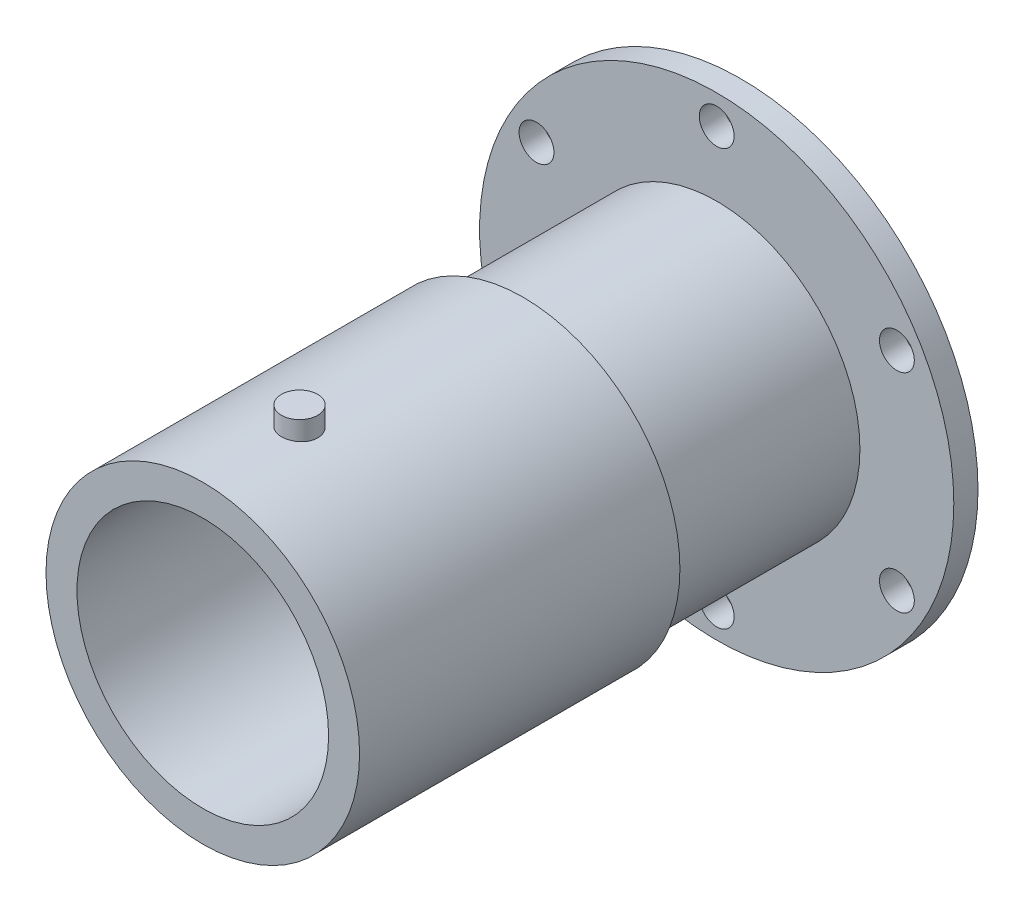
ISO-10303-21;
HEADER;
FILE_DESCRIPTION(('STEP AP214'),'2;1');
FILE_NAME('part.step','',(''),(''),'','','');
FILE_SCHEMA(('AUTOMOTIVE_DESIGN { 1 0 10303 214 1 1 1 1 }'));
ENDSEC;
DATA;
#1=APPLICATION_CONTEXT('core data for automotive mechanical design processes');
#2=APPLICATION_PROTOCOL_DEFINITION('international standard','automotive_design',2000,#1);
#3=PRODUCT_CONTEXT('',#1,'mechanical');
#4=PRODUCT('Part','Part','',(#3));
#5=PRODUCT_RELATED_PRODUCT_CATEGORY('part','',(#4));
#6=PRODUCT_DEFINITION_FORMATION('','',#4);
#7=PRODUCT_DEFINITION_CONTEXT('part definition',#1,'design');
#8=PRODUCT_DEFINITION('design','',#6,#7);
#9=PRODUCT_DEFINITION_SHAPE('','',#8);
#10=(LENGTH_UNIT() NAMED_UNIT(*) SI_UNIT(.MILLI.,.METRE.));
#11=(NAMED_UNIT(*) PLANE_ANGLE_UNIT() SI_UNIT($,.RADIAN.));
#12=(NAMED_UNIT(*) SI_UNIT($,.STERADIAN.) SOLID_ANGLE_UNIT());
#13=UNCERTAINTY_MEASURE_WITH_UNIT(LENGTH_MEASURE(1.E-05),#10,'distance_accuracy_value','');
#14=(GEOMETRIC_REPRESENTATION_CONTEXT(3) GLOBAL_UNCERTAINTY_ASSIGNED_CONTEXT((#13)) GLOBAL_UNIT_ASSIGNED_CONTEXT((#10,
#11,#12)) REPRESENTATION_CONTEXT('',''));
#15=CARTESIAN_POINT('',(0.,0.,0.));
#16=DIRECTION('',(0.,0.,1.));
#17=DIRECTION('',(1.,0.,0.));
#18=AXIS2_PLACEMENT_3D('',#15,#16,#17);
#19=CARTESIAN_POINT('',(0.,0.,141.224));
#20=DIRECTION('',(0.,0.,-1.));
#21=DIRECTION('',(-1.,0.,0.));
#22=AXIS2_PLACEMENT_3D('',#19,#20,#21);
#23=CYLINDRICAL_SURFACE('',#22,41.148);
#24=CARTESIAN_POINT('',(0.,41.148,120.5865));
#25=CARTESIAN_POINT('',(0.133323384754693,41.1480004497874,120.586501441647));
#26=CARTESIAN_POINT('',(0.266625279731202,41.1473507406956,120.580899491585));
#27=CARTESIAN_POINT('',(0.532321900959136,41.1447709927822,120.558533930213));
#28=CARTESIAN_POINT('',(0.664716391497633,41.142840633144,120.541767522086));
#29=CARTESIAN_POINT('',(0.927705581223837,41.1377512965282,120.497175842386));
#30=CARTESIAN_POINT('',(1.05829884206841,41.1345913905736,120.469342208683));
#31=CARTESIAN_POINT('',(1.3167058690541,41.1271309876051,120.402809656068));
#32=CARTESIAN_POINT('',(1.44451859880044,41.1228300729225,120.364106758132));
#33=CARTESIAN_POINT('',(1.69628101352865,41.1132142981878,120.276167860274));
#34=CARTESIAN_POINT('',(1.82023450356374,41.1079004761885,120.226942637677));
#35=CARTESIAN_POINT('',(2.06358982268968,41.0964030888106,120.118271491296));
#36=CARTESIAN_POINT('',(2.18298995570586,41.0902192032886,120.058821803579));
#37=CARTESIAN_POINT('',(2.41629126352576,41.0771601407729,119.930175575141));
#38=CARTESIAN_POINT('',(2.53019546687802,41.0702853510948,119.860984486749));
#39=CARTESIAN_POINT('',(2.75182654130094,41.0560311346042,119.713292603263));
#40=CARTESIAN_POINT('',(2.85955110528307,41.0486515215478,119.634788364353));
#41=CARTESIAN_POINT('',(3.06843487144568,41.0335670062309,119.468720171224));
#42=CARTESIAN_POINT('',(3.16956705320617,41.025860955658,119.381122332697));
#43=CARTESIAN_POINT('',(3.36413849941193,41.0103646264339,119.197701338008));
#44=CARTESIAN_POINT('',(3.45757490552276,41.0025743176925,119.101875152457));
#45=CARTESIAN_POINT('',(3.6360310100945,40.9871346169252,118.902726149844));
#46=CARTESIAN_POINT('',(3.72105338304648,40.9794851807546,118.799405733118));
#47=CARTESIAN_POINT('',(3.88214648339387,40.9645381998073,118.585926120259));
#48=CARTESIAN_POINT('',(3.95821389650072,40.9572407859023,118.475764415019));
#49=CARTESIAN_POINT('',(4.10100293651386,40.9431904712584,118.249109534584));
#50=CARTESIAN_POINT('',(4.16770063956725,40.9364389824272,118.132601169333));
#51=CARTESIAN_POINT('',(4.29105656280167,40.9236919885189,117.894331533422));
#52=CARTESIAN_POINT('',(4.34771105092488,40.9176967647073,117.772568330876));
#53=CARTESIAN_POINT('',(4.50189068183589,40.9011212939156,117.400764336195));
#54=CARTESIAN_POINT('',(4.58379287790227,40.8919348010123,117.143953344));
#55=CARTESIAN_POINT('',(4.70288751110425,40.8784093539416,116.621401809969));
#56=CARTESIAN_POINT('',(4.7402791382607,40.8740488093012,116.355706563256));
#57=CARTESIAN_POINT('',(4.76999474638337,40.8705920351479,115.821741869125));
#58=CARTESIAN_POINT('',(4.76232029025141,40.8714956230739,115.5534725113));
#59=CARTESIAN_POINT('',(4.70226157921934,40.8784481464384,115.023398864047));
#60=CARTESIAN_POINT('',(4.65009565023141,40.8844719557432,114.761569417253));
#61=CARTESIAN_POINT('',(4.50288133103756,40.9009462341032,114.250403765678));
#62=CARTESIAN_POINT('',(4.40783218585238,40.911396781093,114.001067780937));
#63=CARTESIAN_POINT('',(4.17731072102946,40.9355758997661,113.521287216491));
#64=CARTESIAN_POINT('',(4.0417427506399,40.9493122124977,113.290889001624));
#65=CARTESIAN_POINT('',(3.73410090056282,40.9785088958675,112.856031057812));
#66=CARTESIAN_POINT('',(3.56202558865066,40.9939693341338,112.651572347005));
#67=CARTESIAN_POINT('',(3.18503994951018,41.0249841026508,112.273129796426));
#68=CARTESIAN_POINT('',(2.97994131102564,41.0405384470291,112.099333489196));
#69=CARTESIAN_POINT('',(2.5433815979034,41.0699025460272,111.788606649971));
#70=CARTESIAN_POINT('',(2.31192047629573,41.0837122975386,111.651676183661));
#71=CARTESIAN_POINT('',(1.82906731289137,41.1080381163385,111.418570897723));
#72=CARTESIAN_POINT('',(1.57766998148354,41.1185533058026,111.322406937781));
#73=CARTESIAN_POINT('',(1.06214786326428,41.1350969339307,111.173708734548));
#74=CARTESIAN_POINT('',(0.798023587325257,41.1411255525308,111.121172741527));
#75=CARTESIAN_POINT('',(0.26616758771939,41.1479935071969,111.061462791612));
#76=CARTESIAN_POINT('',(-0.001534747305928,41.1488624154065,111.054030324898));
#77=CARTESIAN_POINT('',(-0.534371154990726,41.1453926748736,111.084057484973));
#78=CARTESIAN_POINT('',(-0.799505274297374,41.1410541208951,111.121516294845));
#79=CARTESIAN_POINT('',(-1.31892287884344,41.1276755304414,111.240048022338));
#80=CARTESIAN_POINT('',(-1.57323466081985,41.1186486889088,111.320998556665));
#81=CARTESIAN_POINT('',(-2.06467161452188,41.0969049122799,111.524089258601));
#82=CARTESIAN_POINT('',(-2.30179627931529,41.0841878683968,111.646230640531));
#83=CARTESIAN_POINT('',(-2.75328812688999,41.0564095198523,111.928867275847));
#84=CARTESIAN_POINT('',(-2.96754933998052,41.0413380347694,112.089530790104));
#85=CARTESIAN_POINT('',(-3.36615611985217,41.0105710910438,112.444412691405));
#86=CARTESIAN_POINT('',(-3.55050067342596,40.9948756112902,112.638632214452));
#87=CARTESIAN_POINT('',(-3.88495108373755,40.9645391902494,113.056243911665));
#88=CARTESIAN_POINT('',(-4.03488624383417,40.9499037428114,113.279773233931));
#89=CARTESIAN_POINT('',(-4.29508349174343,40.9234327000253,113.749002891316));
#90=CARTESIAN_POINT('',(-4.4053462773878,40.9115970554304,113.994702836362));
#91=CARTESIAN_POINT('',(-4.58279366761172,40.8921006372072,114.500684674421));
#92=CARTESIAN_POINT('',(-4.65007660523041,40.8844303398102,114.760931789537));
#93=CARTESIAN_POINT('',(-4.73995365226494,40.8741101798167,115.289270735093));
#94=CARTESIAN_POINT('',(-4.76254952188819,40.8714601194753,115.557362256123));
#95=CARTESIAN_POINT('',(-4.76247514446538,40.871464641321,115.958421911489));
#96=CARTESIAN_POINT('',(-4.75684393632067,40.8721229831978,116.09160420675));
#97=CARTESIAN_POINT('',(-4.73444955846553,40.8747238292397,116.357003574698));
#98=CARTESIAN_POINT('',(-4.71769052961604,40.8766658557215,116.489220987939));
#99=CARTESIAN_POINT('',(-4.67315094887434,40.8817814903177,116.751801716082));
#100=CARTESIAN_POINT('',(-4.64536637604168,40.8849555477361,116.882164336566));
#101=CARTESIAN_POINT('',(-4.57899463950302,40.8924421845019,117.140027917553));
#102=CARTESIAN_POINT('',(-4.54041141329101,40.8967543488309,117.267529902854));
#103=CARTESIAN_POINT('',(-4.45271408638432,40.906395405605,117.518832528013));
#104=CARTESIAN_POINT('',(-4.40359895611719,40.9117243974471,117.642632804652));
#105=CARTESIAN_POINT('',(-4.29521401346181,40.9232453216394,117.885609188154));
#106=CARTESIAN_POINT('',(-4.23594789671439,40.9294369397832,118.004786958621));
#107=CARTESIAN_POINT('',(-4.10764755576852,40.9425120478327,118.237779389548));
#108=CARTESIAN_POINT('',(-4.03860980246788,40.9493957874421,118.351592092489));
#109=CARTESIAN_POINT('',(-3.89129627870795,40.9636569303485,118.572980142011));
#110=CARTESIAN_POINT('',(-3.81302384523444,40.9710341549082,118.680557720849));
#111=CARTESIAN_POINT('',(-3.64726447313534,40.9861236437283,118.889411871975));
#112=CARTESIAN_POINT('',(-3.5597243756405,40.9938376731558,118.990646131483));
#113=CARTESIAN_POINT('',(-3.37647466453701,41.0093376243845,119.185352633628));
#114=CARTESIAN_POINT('',(-3.28076803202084,41.0171235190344,119.278827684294));
#115=CARTESIAN_POINT('',(-3.08176585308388,41.0325552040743,119.457457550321));
#116=CARTESIAN_POINT('',(-2.97846574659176,41.040200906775,119.542607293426));
#117=CARTESIAN_POINT('',(-2.76508888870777,41.0551290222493,119.703892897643));
#118=CARTESIAN_POINT('',(-2.65501465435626,41.0624115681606,119.78003207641));
#119=CARTESIAN_POINT('',(-2.42840911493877,41.0764368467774,119.923055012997));
#120=CARTESIAN_POINT('',(-2.31185564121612,41.0831775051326,119.989903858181));
#121=CARTESIAN_POINT('',(-2.07352990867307,41.095895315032,120.113509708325));
#122=CARTESIAN_POINT('',(-1.95175957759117,41.10187274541,120.170270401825));
#123=CARTESIAN_POINT('',(-1.70391949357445,41.1128925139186,120.273275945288));
#124=CARTESIAN_POINT('',(-1.57785325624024,41.1179355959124,120.319529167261));
#125=CARTESIAN_POINT('',(-1.32227290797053,41.1269480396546,120.401226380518));
#126=CARTESIAN_POINT('',(-1.19275963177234,41.1309176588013,120.43667296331));
#127=CARTESIAN_POINT('',(-0.888007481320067,41.1387843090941,120.506378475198));
#128=CARTESIAN_POINT('',(-0.711769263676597,41.1422260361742,120.536393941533));
#129=CARTESIAN_POINT('',(-0.357007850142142,41.1468335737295,120.576453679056));
#130=CARTESIAN_POINT('',(-0.178484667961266,41.147999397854,120.586498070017));
#131=CARTESIAN_POINT('',(0.,41.148,120.5865));
#132=B_SPLINE_CURVE_WITH_KNOTS('',3,(#24,#25,#26,#27,#28,#29,#30,#31,#32,#33,#34,#35,#36,#37,
#38,#39,#40,#41,#42,#43,#44,#45,#46,#47,#48,#49,#50,#51,#52,#53,#54,#55,#56,#57,#58,#59,#60,#61,
#62,#63,#64,#65,#66,#67,#68,#69,#70,#71,#72,#73,#74,#75,#76,#77,#78,#79,#80,#81,#82,#83,#84,#85,
#86,#87,#88,#89,#90,#91,#92,#93,#94,#95,#96,#97,#98,#99,#100,#101,#102,#103,#104,#105,#106,#107,
#108,#109,#110,#111,#112,#113,#114,#115,#116,#117,#118,#119,#120,#121,#122,#123,#124,#125,#126,
#127,#128,#129,#130,#131),.UNSPECIFIED.,.T.,.F.,(4,2,2,2,2,2,2,2,2,2,2,2,2,2,2,2,2,2,2,2,2,2,2,
2,2,2,2,2,2,2,2,2,2,2,2,2,2,2,2,2,2,2,2,2,2,2,2,2,2,2,2,2,2,4),(0.,0.399814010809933,
0.799728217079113,1.19994516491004,1.60030881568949,2.00026434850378,2.40036743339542,
2.80024746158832,3.20027582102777,3.60185224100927,4.00357714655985,4.40517394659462,
4.8069189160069,5.20967171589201,5.61257386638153,6.41748175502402,7.21877388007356,
8.02003821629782,8.81739311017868,9.61476204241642,10.4140283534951,11.2133260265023,
12.0173544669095,12.8213843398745,13.6256282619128,14.429839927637,15.2294378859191,
16.0290212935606,16.8263664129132,17.623735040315,18.424652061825,19.2255962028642,
20.030431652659,20.8352529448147,21.6382262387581,22.4411679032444,22.8406878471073,
23.2400592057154,23.6395763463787,24.0389480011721,24.4383587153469,24.8376243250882,
25.2370345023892,25.6363007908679,26.0379959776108,26.4395451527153,26.841337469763,
27.2429813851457,27.6460960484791,28.0490630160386,28.451707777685,28.8542559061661,
29.3895040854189,29.9247490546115),.UNSPECIFIED.);
#133=CARTESIAN_POINT('',(0.,41.148,120.5865));
#134=VERTEX_POINT('',#133);
#135=EDGE_CURVE('E52',#134,#134,#132,.T.);
#136=ORIENTED_EDGE('',*,*,#135,.F.);
#137=EDGE_LOOP('',(#136));
#138=FACE_BOUND('',#137,.T.);
#139=CARTESIAN_POINT('',(0.,0.,141.224));
#140=DIRECTION('',(0.,0.,1.));
#141=DIRECTION('',(1.,0.,0.));
#142=AXIS2_PLACEMENT_3D('',#139,#140,#141);
#143=CIRCLE('',#142,41.148);
#144=CARTESIAN_POINT('',(41.148,0.,141.224));
#145=VERTEX_POINT('',#144);
#146=EDGE_CURVE('E11',#145,#145,#143,.T.);
#147=ORIENTED_EDGE('',*,*,#146,.F.);
#148=EDGE_LOOP('',(#147));
#149=FACE_BOUND('',#148,.T.);
#150=CARTESIAN_POINT('',(0.,0.,57.15));
#151=DIRECTION('',(0.,0.,1.));
#152=DIRECTION('',(1.,0.,0.));
#153=AXIS2_PLACEMENT_3D('',#150,#151,#152);
#154=CIRCLE('',#153,41.148);
#155=CARTESIAN_POINT('',(41.148,0.,57.15));
#156=VERTEX_POINT('',#155);
#157=EDGE_CURVE('E39',#156,#156,#154,.T.);
#158=ORIENTED_EDGE('',*,*,#157,.T.);
#159=EDGE_LOOP('',(#158));
#160=FACE_BOUND('',#159,.T.);
#161=ADVANCED_FACE('F33',(#138,#149,#160),#23,.T.);
#162=CARTESIAN_POINT('',(0.,0.,141.224));
#163=DIRECTION('',(0.,0.,1.));
#164=DIRECTION('',(1.,0.,0.));
#165=AXIS2_PLACEMENT_3D('',#162,#163,#164);
#166=PLANE('',#165);
#167=CARTESIAN_POINT('',(0.,0.,141.224));
#168=DIRECTION('',(0.,0.,1.));
#169=DIRECTION('',(1.,0.,0.));
#170=AXIS2_PLACEMENT_3D('',#167,#168,#169);
#171=CIRCLE('',#170,33.02);
#172=CARTESIAN_POINT('',(33.02,0.,141.224));
#173=VERTEX_POINT('',#172);
#174=EDGE_CURVE('E47',#173,#173,#171,.T.);
#175=ORIENTED_EDGE('',*,*,#174,.F.);
#176=EDGE_LOOP('',(#175));
#177=FACE_BOUND('',#176,.T.);
#178=ORIENTED_EDGE('',*,*,#146,.T.);
#179=EDGE_LOOP('',(#178));
#180=FACE_BOUND('',#179,.T.);
#181=ADVANCED_FACE('F75',(#177,#180),#166,.T.);
#182=CARTESIAN_POINT('',(0.,0.,57.15));
#183=DIRECTION('',(0.,0.,1.));
#184=DIRECTION('',(1.,0.,0.));
#185=AXIS2_PLACEMENT_3D('',#182,#183,#184);
#186=PLANE('',#185);
#187=ORIENTED_EDGE('',*,*,#157,.F.);
#188=EDGE_LOOP('',(#187));
#189=FACE_BOUND('',#188,.T.);
#190=ADVANCED_FACE('F81',(#189),#186,.F.);
#191=CARTESIAN_POINT('',(0.,0.,87.884));
#192=DIRECTION('',(0.,0.,1.));
#193=DIRECTION('',(1.,0.,0.));
#194=AXIS2_PLACEMENT_3D('',#191,#192,#193);
#195=CYLINDRICAL_SURFACE('',#194,33.02);
#196=CARTESIAN_POINT('',(0.,0.,87.884));
#197=DIRECTION('',(0.,0.,1.));
#198=DIRECTION('',(1.,0.,0.));
#199=AXIS2_PLACEMENT_3D('',#196,#197,#198);
#200=CIRCLE('',#199,33.02);
#201=CARTESIAN_POINT('',(33.02,0.,87.884));
#202=VERTEX_POINT('',#201);
#203=EDGE_CURVE('E43',#202,#202,#200,.T.);
#204=ORIENTED_EDGE('',*,*,#203,.F.);
#205=EDGE_LOOP('',(#204));
#206=FACE_BOUND('',#205,.T.);
#207=ORIENTED_EDGE('',*,*,#174,.T.);
#208=EDGE_LOOP('',(#207));
#209=FACE_BOUND('',#208,.T.);
#210=ADVANCED_FACE('F91',(#206,#209),#195,.F.);
#211=CARTESIAN_POINT('',(0.,0.,87.884));
#212=DIRECTION('',(0.,0.,1.));
#213=DIRECTION('',(1.,0.,0.));
#214=AXIS2_PLACEMENT_3D('',#211,#212,#213);
#215=PLANE('',#214);
#216=ORIENTED_EDGE('',*,*,#203,.T.);
#217=EDGE_LOOP('',(#216));
#218=FACE_BOUND('',#217,.T.);
#219=ADVANCED_FACE('F71',(#218),#215,.T.);
#220=CARTESIAN_POINT('',(0.,-62.231,115.824));
#221=DIRECTION('',(0.,1.,0.));
#222=DIRECTION('',(0.,0.,1.));
#223=AXIS2_PLACEMENT_3D('',#220,#221,#222);
#224=CYLINDRICAL_SURFACE('',#223,4.7625);
#225=ORIENTED_EDGE('',*,*,#135,.T.);
#226=EDGE_LOOP('',(#225));
#227=FACE_BOUND('',#226,.T.);
#228=CARTESIAN_POINT('',(0.,46.0248,115.824));
#229=DIRECTION('',(0.,1.,0.));
#230=DIRECTION('',(0.,0.,1.));
#231=AXIS2_PLACEMENT_3D('',#228,#229,#230);
#232=CIRCLE('',#231,4.7625);
#233=CARTESIAN_POINT('',(0.,46.0248,120.5865));
#234=VERTEX_POINT('',#233);
#235=EDGE_CURVE('E59',#234,#234,#232,.T.);
#236=ORIENTED_EDGE('',*,*,#235,.F.);
#237=EDGE_LOOP('',(#236));
#238=FACE_BOUND('',#237,.T.);
#239=ADVANCED_FACE('F60',(#227,#238),#224,.T.);
#240=CARTESIAN_POINT('',(0.,46.0248,115.824));
#241=DIRECTION('',(0.,1.,0.));
#242=DIRECTION('',(0.,0.,1.));
#243=AXIS2_PLACEMENT_3D('',#240,#241,#242);
#244=PLANE('',#243);
#245=ORIENTED_EDGE('',*,*,#235,.T.);
#246=EDGE_LOOP('',(#245));
#247=FACE_BOUND('',#246,.T.);
#248=ADVANCED_FACE('F65',(#247),#244,.T.);
#249=CLOSED_SHELL('',(#161,#181,#190,#210,#219,#239,#248));
#250=MANIFOLD_SOLID_BREP('B2',#249);
#251=CARTESIAN_POINT('',(0.,0.,57.15));
#252=DIRECTION('',(0.,0.,-1.));
#253=DIRECTION('',(-1.,0.,0.));
#254=AXIS2_PLACEMENT_3D('',#251,#252,#253);
#255=CYLINDRICAL_SURFACE('',#254,37.592);
#256=CARTESIAN_POINT('',(0.,0.,57.15));
#257=DIRECTION('',(0.,0.,1.));
#258=DIRECTION('',(1.,0.,0.));
#259=AXIS2_PLACEMENT_3D('',#256,#257,#258);
#260=CIRCLE('',#259,37.592);
#261=CARTESIAN_POINT('',(37.592,0.,57.15));
#262=VERTEX_POINT('',#261);
#263=EDGE_CURVE('E32',#262,#262,#260,.T.);
#264=ORIENTED_EDGE('',*,*,#263,.F.);
#265=EDGE_LOOP('',(#264));
#266=FACE_BOUND('',#265,.T.);
#267=CARTESIAN_POINT('',(0.,0.,6.35));
#268=DIRECTION('',(0.,0.,1.));
#269=DIRECTION('',(1.,0.,0.));
#270=AXIS2_PLACEMENT_3D('',#267,#268,#269);
#271=CIRCLE('',#270,37.592);
#272=CARTESIAN_POINT('',(37.592,0.,6.35));
#273=VERTEX_POINT('',#272);
#274=EDGE_CURVE('E140',#273,#273,#271,.T.);
#275=ORIENTED_EDGE('',*,*,#274,.T.);
#276=EDGE_LOOP('',(#275));
#277=FACE_BOUND('',#276,.T.);
#278=ADVANCED_FACE('F134',(#266,#277),#255,.T.);
#279=CARTESIAN_POINT('',(0.,0.,57.15));
#280=DIRECTION('',(0.,0.,1.));
#281=DIRECTION('',(1.,0.,0.));
#282=AXIS2_PLACEMENT_3D('',#279,#280,#281);
#283=PLANE('',#282);
#284=ORIENTED_EDGE('',*,*,#263,.T.);
#285=EDGE_LOOP('',(#284));
#286=FACE_BOUND('',#285,.T.);
#287=ADVANCED_FACE('F149',(#286),#283,.T.);
#288=CARTESIAN_POINT('',(0.,0.,6.35));
#289=DIRECTION('',(0.,0.,1.));
#290=DIRECTION('',(1.,0.,0.));
#291=AXIS2_PLACEMENT_3D('',#288,#289,#290);
#292=PLANE('',#291);
#293=ORIENTED_EDGE('',*,*,#274,.F.);
#294=EDGE_LOOP('',(#293));
#295=FACE_BOUND('',#294,.T.);
#296=ADVANCED_FACE('F147',(#295),#292,.F.);
#297=CLOSED_SHELL('',(#278,#287,#296));
#298=MANIFOLD_SOLID_BREP('B6',#297);
#299=CARTESIAN_POINT('',(0.,0.,6.35));
#300=DIRECTION('',(0.,0.,1.));
#301=DIRECTION('',(1.,0.,0.));
#302=AXIS2_PLACEMENT_3D('',#299,#300,#301);
#303=PLANE('',#302);
#304=CARTESIAN_POINT('',(-47.2936473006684,-27.3049999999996,6.35));
#305=DIRECTION('',(0.,0.,-1.));
#306=DIRECTION('',(0.499999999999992,-0.866025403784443,0.));
#307=AXIS2_PLACEMENT_3D('',#304,#305,#306);
#308=CIRCLE('',#307,4.572);
#309=CARTESIAN_POINT('',(-45.0076473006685,-31.264468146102,6.35));
#310=VERTEX_POINT('',#309);
#311=EDGE_CURVE('E206',#310,#310,#308,.T.);
#312=ORIENTED_EDGE('',*,*,#311,.T.);
#313=EDGE_LOOP('',(#312));
#314=FACE_BOUND('',#313,.T.);
#315=CARTESIAN_POINT('',(47.2936473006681,-27.3050000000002,6.35));
#316=DIRECTION('',(0.,0.,-1.));
#317=DIRECTION('',(0.500000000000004,0.866025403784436,0.));
#318=AXIS2_PLACEMENT_3D('',#315,#316,#317);
#319=CIRCLE('',#318,4.572);
#320=CARTESIAN_POINT('',(49.5796473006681,-23.3455318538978,6.35));
#321=VERTEX_POINT('',#320);
#322=EDGE_CURVE('E194',#321,#321,#319,.T.);
#323=ORIENTED_EDGE('',*,*,#322,.T.);
#324=EDGE_LOOP('',(#323));
#325=FACE_BOUND('',#324,.T.);
#326=CARTESIAN_POINT('',(0.,54.61,6.35));
#327=DIRECTION('',(0.,0.,-1.));
#328=DIRECTION('',(-1.,0.,0.));
#329=AXIS2_PLACEMENT_3D('',#326,#327,#328);
#330=CIRCLE('',#329,4.572);
#331=CARTESIAN_POINT('',(-4.572,54.61,6.35));
#332=VERTEX_POINT('',#331);
#333=EDGE_CURVE('E183',#332,#332,#330,.T.);
#334=ORIENTED_EDGE('',*,*,#333,.T.);
#335=EDGE_LOOP('',(#334));
#336=FACE_BOUND('',#335,.T.);
#337=CARTESIAN_POINT('',(0.,0.,6.35));
#338=DIRECTION('',(0.,0.,1.));
#339=DIRECTION('',(1.,0.,0.));
#340=AXIS2_PLACEMENT_3D('',#337,#338,#339);
#341=CIRCLE('',#340,62.23);
#342=CARTESIAN_POINT('',(62.23,0.,6.35));
#343=VERTEX_POINT('',#342);
#344=EDGE_CURVE('E133',#343,#343,#341,.T.);
#345=ORIENTED_EDGE('',*,*,#344,.T.);
#346=EDGE_LOOP('',(#345));
#347=FACE_BOUND('',#346,.T.);
#348=CARTESIAN_POINT('',(47.2936473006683,27.3049999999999,6.35));
#349=DIRECTION('',(0.,0.,-1.));
#350=DIRECTION('',(-0.499999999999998,0.86602540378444,0.));
#351=AXIS2_PLACEMENT_3D('',#348,#349,#350);
#352=CIRCLE('',#351,4.572);
#353=CARTESIAN_POINT('',(45.0076473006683,31.2644681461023,6.35));
#354=VERTEX_POINT('',#353);
#355=EDGE_CURVE('E188',#354,#354,#352,.T.);
#356=ORIENTED_EDGE('',*,*,#355,.T.);
#357=EDGE_LOOP('',(#356));
#358=FACE_BOUND('',#357,.T.);
#359=CARTESIAN_POINT('',(-3.81339812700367E-13,-54.61,6.35));
#360=DIRECTION('',(0.,0.,-1.));
#361=DIRECTION('',(1.,0.,0.));
#362=AXIS2_PLACEMENT_3D('',#359,#360,#361);
#363=CIRCLE('',#362,4.572);
#364=CARTESIAN_POINT('',(4.57199999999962,-54.61,6.35));
#365=VERTEX_POINT('',#364);
#366=EDGE_CURVE('E200',#365,#365,#363,.T.);
#367=ORIENTED_EDGE('',*,*,#366,.T.);
#368=EDGE_LOOP('',(#367));
#369=FACE_BOUND('',#368,.T.);
#370=CARTESIAN_POINT('',(-47.2936473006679,27.3050000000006,6.35));
#371=DIRECTION('',(0.,0.,-1.));
#372=DIRECTION('',(-0.50000000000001,-0.866025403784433,0.));
#373=AXIS2_PLACEMENT_3D('',#370,#371,#372);
#374=CIRCLE('',#373,4.572);
#375=CARTESIAN_POINT('',(-49.5796473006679,23.3455318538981,6.35));
#376=VERTEX_POINT('',#375);
#377=EDGE_CURVE('E212',#376,#376,#374,.T.);
#378=ORIENTED_EDGE('',*,*,#377,.T.);
#379=EDGE_LOOP('',(#378));
#380=FACE_BOUND('',#379,.T.);
#381=ADVANCED_FACE('F168',(#314,#325,#336,#347,#358,#369,#380),#303,.T.);
#382=CARTESIAN_POINT('',(0.,0.,0.));
#383=DIRECTION('',(0.,0.,1.));
#384=DIRECTION('',(1.,0.,0.));
#385=AXIS2_PLACEMENT_3D('',#382,#383,#384);
#386=PLANE('',#385);
#387=CARTESIAN_POINT('',(-47.2936473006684,-27.3049999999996,0.));
#388=DIRECTION('',(0.,0.,-1.));
#389=DIRECTION('',(0.499999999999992,-0.866025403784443,0.));
#390=AXIS2_PLACEMENT_3D('',#387,#388,#389);
#391=CIRCLE('',#390,4.572);
#392=CARTESIAN_POINT('',(-45.0076473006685,-31.264468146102,0.));
#393=VERTEX_POINT('',#392);
#394=EDGE_CURVE('E209',#393,#393,#391,.T.);
#395=ORIENTED_EDGE('',*,*,#394,.F.);
#396=EDGE_LOOP('',(#395));
#397=FACE_BOUND('',#396,.T.);
#398=CARTESIAN_POINT('',(47.2936473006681,-27.3050000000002,0.));
#399=DIRECTION('',(0.,0.,-1.));
#400=DIRECTION('',(0.500000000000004,0.866025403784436,0.));
#401=AXIS2_PLACEMENT_3D('',#398,#399,#400);
#402=CIRCLE('',#401,4.572);
#403=CARTESIAN_POINT('',(49.5796473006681,-23.3455318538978,0.));
#404=VERTEX_POINT('',#403);
#405=EDGE_CURVE('E197',#404,#404,#402,.T.);
#406=ORIENTED_EDGE('',*,*,#405,.F.);
#407=EDGE_LOOP('',(#406));
#408=FACE_BOUND('',#407,.T.);
#409=CARTESIAN_POINT('',(0.,54.61,0.));
#410=DIRECTION('',(0.,0.,-1.));
#411=DIRECTION('',(-1.,0.,0.));
#412=AXIS2_PLACEMENT_3D('',#409,#410,#411);
#413=CIRCLE('',#412,4.572);
#414=CARTESIAN_POINT('',(-4.572,54.61,0.));
#415=VERTEX_POINT('',#414);
#416=EDGE_CURVE('E179',#415,#415,#413,.T.);
#417=ORIENTED_EDGE('',*,*,#416,.F.);
#418=EDGE_LOOP('',(#417));
#419=FACE_BOUND('',#418,.T.);
#420=CARTESIAN_POINT('',(0.,0.,0.));
#421=DIRECTION('',(0.,0.,1.));
#422=DIRECTION('',(1.,0.,0.));
#423=AXIS2_PLACEMENT_3D('',#420,#421,#422);
#424=CIRCLE('',#423,62.23);
#425=CARTESIAN_POINT('',(62.23,0.,0.));
#426=VERTEX_POINT('',#425);
#427=EDGE_CURVE('E175',#426,#426,#424,.T.);
#428=ORIENTED_EDGE('',*,*,#427,.F.);
#429=EDGE_LOOP('',(#428));
#430=FACE_BOUND('',#429,.T.);
#431=CARTESIAN_POINT('',(47.2936473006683,27.3049999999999,0.));
#432=DIRECTION('',(0.,0.,-1.));
#433=DIRECTION('',(-0.499999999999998,0.86602540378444,0.));
#434=AXIS2_PLACEMENT_3D('',#431,#432,#433);
#435=CIRCLE('',#434,4.572);
#436=CARTESIAN_POINT('',(45.0076473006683,31.2644681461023,0.));
#437=VERTEX_POINT('',#436);
#438=EDGE_CURVE('E191',#437,#437,#435,.T.);
#439=ORIENTED_EDGE('',*,*,#438,.F.);
#440=EDGE_LOOP('',(#439));
#441=FACE_BOUND('',#440,.T.);
#442=CARTESIAN_POINT('',(-3.81339812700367E-13,-54.61,0.));
#443=DIRECTION('',(0.,0.,-1.));
#444=DIRECTION('',(1.,0.,0.));
#445=AXIS2_PLACEMENT_3D('',#442,#443,#444);
#446=CIRCLE('',#445,4.572);
#447=CARTESIAN_POINT('',(4.57199999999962,-54.61,0.));
#448=VERTEX_POINT('',#447);
#449=EDGE_CURVE('E203',#448,#448,#446,.T.);
#450=ORIENTED_EDGE('',*,*,#449,.F.);
#451=EDGE_LOOP('',(#450));
#452=FACE_BOUND('',#451,.T.);
#453=CARTESIAN_POINT('',(-47.2936473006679,27.3050000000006,0.));
#454=DIRECTION('',(0.,0.,-1.));
#455=DIRECTION('',(-0.50000000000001,-0.866025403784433,0.));
#456=AXIS2_PLACEMENT_3D('',#453,#454,#455);
#457=CIRCLE('',#456,4.572);
#458=CARTESIAN_POINT('',(-49.5796473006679,23.3455318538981,0.));
#459=VERTEX_POINT('',#458);
#460=EDGE_CURVE('E215',#459,#459,#457,.T.);
#461=ORIENTED_EDGE('',*,*,#460,.F.);
#462=EDGE_LOOP('',(#461));
#463=FACE_BOUND('',#462,.T.);
#464=ADVANCED_FACE('F222',(#397,#408,#419,#430,#441,#452,#463),#386,.F.);
#465=CARTESIAN_POINT('',(0.,0.,6.35));
#466=DIRECTION('',(0.,0.,-1.));
#467=DIRECTION('',(-1.,0.,0.));
#468=AXIS2_PLACEMENT_3D('',#465,#466,#467);
#469=CYLINDRICAL_SURFACE('',#468,62.23);
#470=ORIENTED_EDGE('',*,*,#344,.F.);
#471=EDGE_LOOP('',(#470));
#472=FACE_BOUND('',#471,.T.);
#473=ORIENTED_EDGE('',*,*,#427,.T.);
#474=EDGE_LOOP('',(#473));
#475=FACE_BOUND('',#474,.T.);
#476=ADVANCED_FACE('F170',(#472,#475),#469,.T.);
#477=CARTESIAN_POINT('',(0.,54.61,0.));
#478=DIRECTION('',(0.,0.,1.));
#479=DIRECTION('',(1.,0.,0.));
#480=AXIS2_PLACEMENT_3D('',#477,#478,#479);
#481=CYLINDRICAL_SURFACE('',#480,4.572);
#482=ORIENTED_EDGE('',*,*,#416,.T.);
#483=EDGE_LOOP('',(#482));
#484=FACE_BOUND('',#483,.T.);
#485=ORIENTED_EDGE('',*,*,#333,.F.);
#486=EDGE_LOOP('',(#485));
#487=FACE_BOUND('',#486,.T.);
#488=ADVANCED_FACE('F231',(#484,#487),#481,.F.);
#489=CARTESIAN_POINT('',(47.2936473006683,27.3049999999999,0.));
#490=DIRECTION('',(0.,0.,1.));
#491=DIRECTION('',(0.499999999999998,-0.86602540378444,0.));
#492=AXIS2_PLACEMENT_3D('',#489,#490,#491);
#493=CYLINDRICAL_SURFACE('',#492,4.572);
#494=ORIENTED_EDGE('',*,*,#438,.T.);
#495=EDGE_LOOP('',(#494));
#496=FACE_BOUND('',#495,.T.);
#497=ORIENTED_EDGE('',*,*,#355,.F.);
#498=EDGE_LOOP('',(#497));
#499=FACE_BOUND('',#498,.T.);
#500=ADVANCED_FACE('F239',(#496,#499),#493,.F.);
#501=CARTESIAN_POINT('',(47.2936473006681,-27.3050000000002,0.));
#502=DIRECTION('',(0.,0.,1.));
#503=DIRECTION('',(-0.500000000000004,-0.866025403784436,0.));
#504=AXIS2_PLACEMENT_3D('',#501,#502,#503);
#505=CYLINDRICAL_SURFACE('',#504,4.572);
#506=ORIENTED_EDGE('',*,*,#405,.T.);
#507=EDGE_LOOP('',(#506));
#508=FACE_BOUND('',#507,.T.);
#509=ORIENTED_EDGE('',*,*,#322,.F.);
#510=EDGE_LOOP('',(#509));
#511=FACE_BOUND('',#510,.T.);
#512=ADVANCED_FACE('F242',(#508,#511),#505,.F.);
#513=CARTESIAN_POINT('',(-3.81339812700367E-13,-54.61,0.));
#514=DIRECTION('',(0.,0.,1.));
#515=DIRECTION('',(-1.,0.,0.));
#516=AXIS2_PLACEMENT_3D('',#513,#514,#515);
#517=CYLINDRICAL_SURFACE('',#516,4.572);
#518=ORIENTED_EDGE('',*,*,#449,.T.);
#519=EDGE_LOOP('',(#518));
#520=FACE_BOUND('',#519,.T.);
#521=ORIENTED_EDGE('',*,*,#366,.F.);
#522=EDGE_LOOP('',(#521));
#523=FACE_BOUND('',#522,.T.);
#524=ADVANCED_FACE('F246',(#520,#523),#517,.F.);
#525=CARTESIAN_POINT('',(-47.2936473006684,-27.3049999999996,0.));
#526=DIRECTION('',(0.,0.,1.));
#527=DIRECTION('',(-0.499999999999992,0.866025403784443,0.));
#528=AXIS2_PLACEMENT_3D('',#525,#526,#527);
#529=CYLINDRICAL_SURFACE('',#528,4.572);
#530=ORIENTED_EDGE('',*,*,#394,.T.);
#531=EDGE_LOOP('',(#530));
#532=FACE_BOUND('',#531,.T.);
#533=ORIENTED_EDGE('',*,*,#311,.F.);
#534=EDGE_LOOP('',(#533));
#535=FACE_BOUND('',#534,.T.);
#536=ADVANCED_FACE('F250',(#532,#535),#529,.F.);
#537=CARTESIAN_POINT('',(-47.2936473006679,27.3050000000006,0.));
#538=DIRECTION('',(0.,0.,1.));
#539=DIRECTION('',(0.50000000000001,0.866025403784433,0.));
#540=AXIS2_PLACEMENT_3D('',#537,#538,#539);
#541=CYLINDRICAL_SURFACE('',#540,4.572);
#542=ORIENTED_EDGE('',*,*,#460,.T.);
#543=EDGE_LOOP('',(#542));
#544=FACE_BOUND('',#543,.T.);
#545=ORIENTED_EDGE('',*,*,#377,.F.);
#546=EDGE_LOOP('',(#545));
#547=FACE_BOUND('',#546,.T.);
#548=ADVANCED_FACE('F219',(#544,#547),#541,.F.);
#549=CLOSED_SHELL('',(#381,#464,#476,#488,#500,#512,#524,#536,#548));
#550=MANIFOLD_SOLID_BREP('B27',#549);
#551=ADVANCED_BREP_SHAPE_REPRESENTATION('',(#18,#250,#298,#550),#14);
#552=SHAPE_DEFINITION_REPRESENTATION(#9,#551);
ENDSEC;
END-ISO-10303-21;
